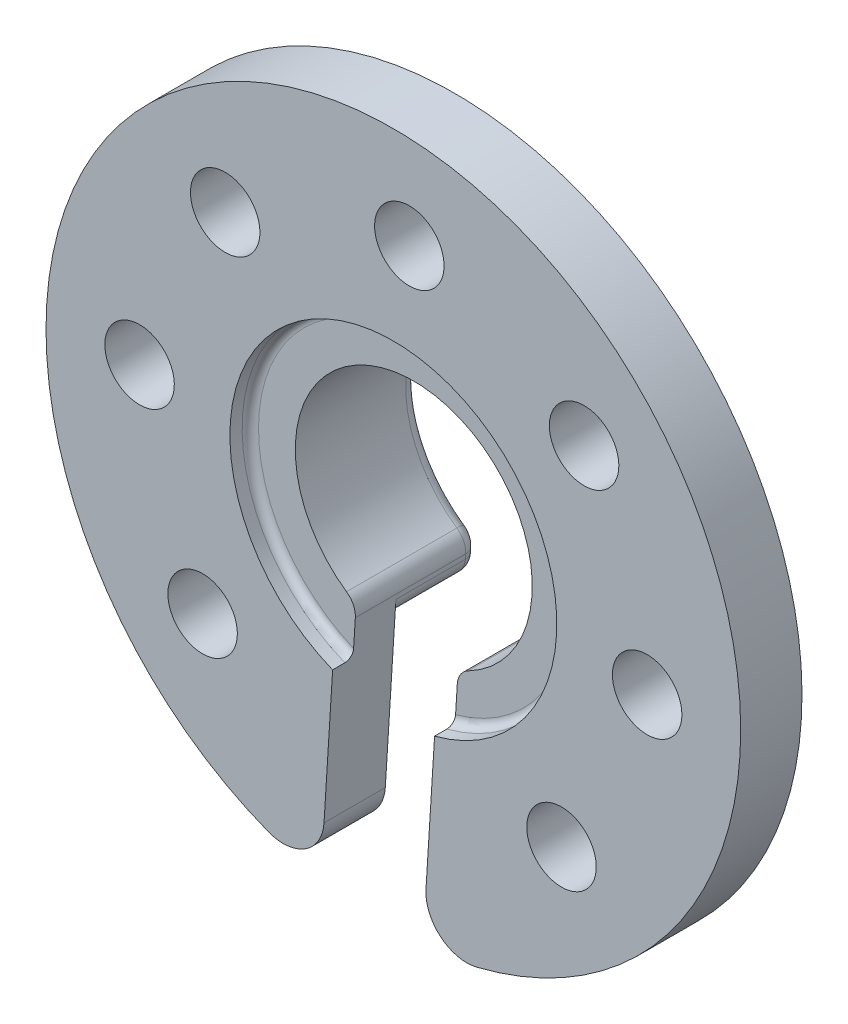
ISO-10303-21;
HEADER;
FILE_DESCRIPTION(('STEP AP214'),'2;1');
FILE_NAME('part.step','',(''),(''),'','','');
FILE_SCHEMA(('AUTOMOTIVE_DESIGN { 1 0 10303 214 1 1 1 1 }'));
ENDSEC;
DATA;
#1=APPLICATION_CONTEXT('core data for automotive mechanical design processes');
#2=APPLICATION_PROTOCOL_DEFINITION('international standard','automotive_design',2000,#1);
#3=PRODUCT_CONTEXT('',#1,'mechanical');
#4=PRODUCT('Part','Part','',(#3));
#5=PRODUCT_RELATED_PRODUCT_CATEGORY('part','',(#4));
#6=PRODUCT_DEFINITION_FORMATION('','',#4);
#7=PRODUCT_DEFINITION_CONTEXT('part definition',#1,'design');
#8=PRODUCT_DEFINITION('design','',#6,#7);
#9=PRODUCT_DEFINITION_SHAPE('','',#8);
#10=(LENGTH_UNIT() NAMED_UNIT(*) SI_UNIT(.MILLI.,.METRE.));
#11=(NAMED_UNIT(*) PLANE_ANGLE_UNIT() SI_UNIT($,.RADIAN.));
#12=(NAMED_UNIT(*) SI_UNIT($,.STERADIAN.) SOLID_ANGLE_UNIT());
#13=UNCERTAINTY_MEASURE_WITH_UNIT(LENGTH_MEASURE(1.E-05),#10,'distance_accuracy_value','');
#14=(GEOMETRIC_REPRESENTATION_CONTEXT(3) GLOBAL_UNCERTAINTY_ASSIGNED_CONTEXT((#13)) GLOBAL_UNIT_ASSIGNED_CONTEXT((#10,
#11,#12)) REPRESENTATION_CONTEXT('',''));
#15=CARTESIAN_POINT('',(0.,0.,0.));
#16=DIRECTION('',(0.,0.,1.));
#17=DIRECTION('',(1.,0.,0.));
#18=AXIS2_PLACEMENT_3D('',#15,#16,#17);
#19=CARTESIAN_POINT('',(3.0712856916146,1.47373350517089,-0.5));
#20=DIRECTION('',(0.,0.,1.));
#21=DIRECTION('',(0.,-1.,0.));
#22=AXIS2_PLACEMENT_3D('',#19,#20,#21);
#23=PLANE('',#22);
#24=DIRECTION('',(0.0627905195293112,0.998026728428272,0.));
#25=VECTOR('',#24,1.);
#26=CARTESIAN_POINT('',(-1.47285865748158,-3.5029540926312,-0.500000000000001));
#27=LINE('',#26,#25);
#28=CARTESIAN_POINT('',(-1.47285865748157,-3.50295409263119,-0.499999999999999));
#29=VERTEX_POINT('',#28);
#30=CARTESIAN_POINT('',(-1.43057073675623,-2.83080684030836,-0.5));
#31=VERTEX_POINT('',#30);
#32=EDGE_CURVE('E152',#29,#31,#27,.T.);
#33=ORIENTED_EDGE('',*,*,#32,.T.);
#34=CARTESIAN_POINT('',(-1.9295841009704,-2.7994115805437,-0.5));
#35=DIRECTION('',(0.,0.,-1.));
#36=DIRECTION('',(0.,1.,0.));
#37=AXIS2_PLACEMENT_3D('',#34,#35,#36);
#38=CIRCLE('',#37,0.5);
#39=CARTESIAN_POINT('',(-1.64582173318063,-2.38773340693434,-0.5));
#40=VERTEX_POINT('',#39);
#41=EDGE_CURVE('E171',#31,#40,#38,.F.);
#42=ORIENTED_EDGE('',*,*,#41,.T.);
#43=CARTESIAN_POINT('',(0.,0.,-0.5));
#44=DIRECTION('',(0.,0.,-1.));
#45=DIRECTION('',(0.,1.,0.));
#46=AXIS2_PLACEMENT_3D('',#43,#44,#45);
#47=CIRCLE('',#46,2.9);
#48=CARTESIAN_POINT('',(1.33358158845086,-2.57518157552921,-0.5));
#49=VERTEX_POINT('',#48);
#50=EDGE_CURVE('E474',#40,#49,#47,.T.);
#51=ORIENTED_EDGE('',*,*,#50,.T.);
#52=CARTESIAN_POINT('',(1.5635094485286,-3.0191783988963,-0.5));
#53=DIRECTION('',(0.,0.,-1.));
#54=DIRECTION('',(0.,1.,0.));
#55=AXIS2_PLACEMENT_3D('',#52,#53,#54);
#56=CIRCLE('',#55,0.5);
#57=CARTESIAN_POINT('',(1.06449608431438,-2.98778313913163,-0.5));
#58=VERTEX_POINT('',#57);
#59=EDGE_CURVE('E116',#49,#58,#56,.F.);
#60=ORIENTED_EDGE('',*,*,#59,.T.);
#61=DIRECTION('',(-0.0627905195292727,-0.998026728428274,0.));
#62=VECTOR('',#61,1.);
#63=CARTESIAN_POINT('',(1.06449608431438,-2.98778313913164,-0.500000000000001));
#64=LINE('',#63,#62);
#65=CARTESIAN_POINT('',(1.02220816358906,-3.65993039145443,-0.499999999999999));
#66=VERTEX_POINT('',#65);
#67=EDGE_CURVE('E142',#58,#66,#64,.T.);
#68=ORIENTED_EDGE('',*,*,#67,.T.);
#69=CARTESIAN_POINT('',(0.,0.,-0.499999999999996));
#70=DIRECTION('',(0.,0.,-1.));
#71=DIRECTION('',(0.,1.,0.));
#72=AXIS2_PLACEMENT_3D('',#69,#70,#71);
#73=CIRCLE('',#72,3.8);
#74=CARTESIAN_POINT('',(0.,3.79999999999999,-0.499999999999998));
#75=VERTEX_POINT('',#74);
#76=EDGE_CURVE('E147',#66,#75,#73,.F.);
#77=ORIENTED_EDGE('',*,*,#76,.T.);
#78=CARTESIAN_POINT('',(0.,0.,-0.499999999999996));
#79=DIRECTION('',(0.,0.,-1.));
#80=DIRECTION('',(-0.387594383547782,-0.921830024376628,0.));
#81=AXIS2_PLACEMENT_3D('',#78,#79,#80);
#82=CIRCLE('',#81,3.79999999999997);
#83=EDGE_CURVE('E169',#75,#29,#82,.F.);
#84=ORIENTED_EDGE('',*,*,#83,.T.);
#85=EDGE_LOOP('',(#33,#42,#51,#60,#68,#77,#84));
#86=FACE_BOUND('',#85,.T.);
#87=ADVANCED_FACE('F17',(#86),#23,.T.);
#88=CARTESIAN_POINT('',(0.,0.,-3.20000000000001));
#89=DIRECTION('',(0.,0.,-1.));
#90=DIRECTION('',(-1.,0.,0.));
#91=AXIS2_PLACEMENT_3D('',#88,#89,#90);
#92=TOROIDAL_SURFACE('',#91,3.19999999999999,0.299999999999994);
#93=CARTESIAN_POINT('',(1.47153830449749,-2.84157966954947,-3.2));
#94=DIRECTION('',(-0.887993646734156,-0.459855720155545,0.));
#95=DIRECTION('',(0.459855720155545,-0.887993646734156,0.));
#96=AXIS2_PLACEMENT_3D('',#93,#94,#95);
#97=CIRCLE('',#96,0.3);
#98=CARTESIAN_POINT('',(1.33358158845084,-2.57518157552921,-3.2));
#99=VERTEX_POINT('',#98);
#100=CARTESIAN_POINT('',(1.47153830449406,-2.84157966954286,-3.5));
#101=VERTEX_POINT('',#100);
#102=EDGE_CURVE('E124',#99,#101,#97,.T.);
#103=ORIENTED_EDGE('',*,*,#102,.F.);
#104=CARTESIAN_POINT('',(0.,0.,-3.2));
#105=DIRECTION('',(0.,0.,-1.));
#106=DIRECTION('',(0.,1.,0.));
#107=AXIS2_PLACEMENT_3D('',#104,#105,#106);
#108=CIRCLE('',#107,2.9);
#109=CARTESIAN_POINT('',(-1.64582173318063,-2.38773340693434,-3.2));
#110=VERTEX_POINT('',#109);
#111=EDGE_CURVE('E475',#99,#110,#108,.F.);
#112=ORIENTED_EDGE('',*,*,#111,.T.);
#113=CARTESIAN_POINT('',(-1.81607915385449,-2.63474031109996,-3.2));
#114=DIRECTION('',(0.823356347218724,-0.567524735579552,0.));
#115=DIRECTION('',(0.567524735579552,0.823356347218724,0.));
#116=AXIS2_PLACEMENT_3D('',#113,#114,#115);
#117=CIRCLE('',#116,0.3);
#118=CARTESIAN_POINT('',(-1.81607915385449,-2.63474031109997,-3.5));
#119=VERTEX_POINT('',#118);
#120=EDGE_CURVE('E163',#119,#110,#117,.T.);
#121=ORIENTED_EDGE('',*,*,#120,.F.);
#122=CARTESIAN_POINT('',(0.,0.,-3.5));
#123=DIRECTION('',(0.,0.,-1.));
#124=DIRECTION('',(-0.567524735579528,-0.82335634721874,0.));
#125=AXIS2_PLACEMENT_3D('',#122,#123,#124);
#126=CIRCLE('',#125,3.19999999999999);
#127=CARTESIAN_POINT('',(-1.17758369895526E-07,3.19999999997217,-3.5));
#128=VERTEX_POINT('',#127);
#129=EDGE_CURVE('E219',#119,#128,#126,.T.);
#130=ORIENTED_EDGE('',*,*,#129,.T.);
#131=CARTESIAN_POINT('',(0.,0.,-3.5));
#132=DIRECTION('',(0.,0.,-1.));
#133=DIRECTION('',(-3.67994890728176E-08,0.999999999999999,0.));
#134=AXIS2_PLACEMENT_3D('',#131,#132,#133);
#135=CIRCLE('',#134,3.19999999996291);
#136=EDGE_CURVE('E208',#128,#101,#135,.T.);
#137=ORIENTED_EDGE('',*,*,#136,.T.);
#138=EDGE_LOOP('',(#103,#112,#121,#130,#137));
#139=FACE_BOUND('',#138,.T.);
#140=ADVANCED_FACE('F191',(#139),#92,.T.);
#141=CARTESIAN_POINT('',(0.,0.,-0.299999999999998));
#142=DIRECTION('',(0.,0.,1.));
#143=DIRECTION('',(1.,0.,0.));
#144=AXIS2_PLACEMENT_3D('',#141,#142,#143);
#145=TOROIDAL_SURFACE('',#144,3.80000000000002,0.199999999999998);
#146=CARTESIAN_POINT('',(0.,0.,-0.299999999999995));
#147=DIRECTION('',(0.,0.,1.));
#148=DIRECTION('',(0.,-1.,0.));
#149=AXIS2_PLACEMENT_3D('',#146,#147,#148);
#150=CIRCLE('',#149,4.);
#151=CARTESIAN_POINT('',(1.00895009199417,-3.87066140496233,-0.299999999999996));
#152=VERTEX_POINT('',#151);
#153=CARTESIAN_POINT('',(-1.48611672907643,-3.71368510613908,-0.299999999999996));
#154=VERTEX_POINT('',#153);
#155=EDGE_CURVE('E201',#152,#154,#150,.T.);
#156=ORIENTED_EDGE('',*,*,#155,.T.);
#157=CARTESIAN_POINT('',(-1.47285865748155,-3.50295409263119,-0.499999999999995));
#158=CARTESIAN_POINT('',(-1.47363704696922,-3.51532623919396,-0.500007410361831));
#159=CARTESIAN_POINT('',(-1.47441558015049,-3.52770066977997,-0.498972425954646));
#160=CARTESIAN_POINT('',(-1.47595192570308,-3.55212018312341,-0.494859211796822));
#161=CARTESIAN_POINT('',(-1.47670971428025,-3.56416488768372,-0.491778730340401));
#162=CARTESIAN_POINT('',(-1.4781826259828,-3.58757614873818,-0.483611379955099));
#163=CARTESIAN_POINT('',(-1.47889769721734,-3.59894188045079,-0.478522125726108));
#164=CARTESIAN_POINT('',(-1.48026122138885,-3.6206144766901,-0.46644727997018));
#165=CARTESIAN_POINT('',(-1.48090972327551,-3.63092211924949,-0.459463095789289));
#166=CARTESIAN_POINT('',(-1.48209957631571,-3.6498342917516,-0.444007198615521));
#167=CARTESIAN_POINT('',(-1.48264362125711,-3.65848163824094,-0.435588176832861));
#168=CARTESIAN_POINT('',(-1.48362904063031,-3.6741444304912,-0.417345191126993));
#169=CARTESIAN_POINT('',(-1.48407046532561,-3.6811606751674,-0.407521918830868));
#170=CARTESIAN_POINT('',(-1.48481369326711,-3.69297394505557,-0.387301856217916));
#171=CARTESIAN_POINT('',(-1.48512158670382,-3.69786777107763,-0.376961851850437));
#172=CARTESIAN_POINT('',(-1.48561767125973,-3.705752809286,-0.355590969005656));
#173=CARTESIAN_POINT('',(-1.48580602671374,-3.70874663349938,-0.344561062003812));
#174=CARTESIAN_POINT('',(-1.48605484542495,-3.71270149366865,-0.322351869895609));
#175=CARTESIAN_POINT('',(-1.48611759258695,-3.71369883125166,-0.311179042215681));
#176=CARTESIAN_POINT('',(-1.48611672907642,-3.71368510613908,-0.299999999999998));
#177=B_SPLINE_CURVE_WITH_KNOTS('',3,(#157,#158,#159,#160,#161,#162,#163,#164,#165,#166,#167,
#168,#169,#170,#171,#172,#173,#174,#175,#176),.UNSPECIFIED.,.F.,.F.,(4,2,2,2,2,2,2,2,2,4),(0.,
0.0371508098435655,0.0743425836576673,0.111578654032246,0.148787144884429,0.184844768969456,
0.220884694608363,0.255041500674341,0.289151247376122,0.322634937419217),.UNSPECIFIED.);
#178=EDGE_CURVE('E164',#29,#154,#177,.T.);
#179=ORIENTED_EDGE('',*,*,#178,.F.);
#180=ORIENTED_EDGE('',*,*,#83,.F.);
#181=ORIENTED_EDGE('',*,*,#76,.F.);
#182=CARTESIAN_POINT('',(1.00895009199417,-3.87066140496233,-0.299999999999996));
#183=CARTESIAN_POINT('',(1.00894939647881,-3.87067245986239,-0.310839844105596));
#184=CARTESIAN_POINT('',(1.00900831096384,-3.86973604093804,-0.321673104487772));
#185=CARTESIAN_POINT('',(1.00923981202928,-3.86605643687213,-0.343004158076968));
#186=CARTESIAN_POINT('',(1.00941215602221,-3.86331710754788,-0.353502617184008));
#187=CARTESIAN_POINT('',(1.00986501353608,-3.85611914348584,-0.373890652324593));
#188=CARTESIAN_POINT('',(1.01014552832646,-3.85166048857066,-0.383780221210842));
#189=CARTESIAN_POINT('',(1.01080426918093,-3.84119010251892,-0.402686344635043));
#190=CARTESIAN_POINT('',(1.01118251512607,-3.83517805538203,-0.411702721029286));
#191=CARTESIAN_POINT('',(1.01246370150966,-3.8148141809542,-0.437439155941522));
#192=CARTESIAN_POINT('',(1.01350463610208,-3.79826899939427,-0.452479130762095));
#193=CARTESIAN_POINT('',(1.01588186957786,-3.76048395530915,-0.477257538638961));
#194=CARTESIAN_POINT('',(1.01722992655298,-3.73905720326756,-0.486707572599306));
#195=CARTESIAN_POINT('',(1.01921442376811,-3.7075145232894,-0.495075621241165));
#196=CARTESIAN_POINT('',(1.0198075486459,-3.69808707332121,-0.496921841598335));
#197=CARTESIAN_POINT('',(1.02100288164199,-3.67908779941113,-0.499381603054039));
#198=CARTESIAN_POINT('',(1.02160507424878,-3.66951622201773,-0.499997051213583));
#199=CARTESIAN_POINT('',(1.02220816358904,-3.65993039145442,-0.499999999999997));
#200=B_SPLINE_CURVE_WITH_KNOTS('',3,(#182,#183,#184,#185,#186,#187,#188,#189,#190,#191,#192,
#193,#194,#195,#196,#197,#198,#199),.UNSPECIFIED.,.F.,.F.,(4,2,2,2,2,2,2,2,4),(0.,
0.0324686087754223,0.0648680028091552,0.0972677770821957,0.129674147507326,0.195605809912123,
0.264695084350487,0.293505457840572,0.322271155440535),.UNSPECIFIED.);
#201=EDGE_CURVE('E155',#152,#66,#200,.T.);
#202=ORIENTED_EDGE('',*,*,#201,.F.);
#203=EDGE_LOOP('',(#156,#179,#180,#181,#202));
#204=FACE_BOUND('',#203,.T.);
#205=ADVANCED_FACE('F167',(#204),#145,.F.);
#206=CARTESIAN_POINT('',(-1.9295841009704,-2.7994115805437,-3.2));
#207=DIRECTION('',(0.,0.,-1.));
#208=DIRECTION('',(-1.,0.,0.));
#209=AXIS2_PLACEMENT_3D('',#206,#207,#208);
#210=DEGENERATE_TOROIDAL_SURFACE('',#209,0.199999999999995,0.3,.T.);
#211=CARTESIAN_POINT('',(-1.9295841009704,-2.7994115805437,-3.5));
#212=DIRECTION('',(0.,0.,-1.));
#213=DIRECTION('',(-1.,0.,0.));
#214=AXIS2_PLACEMENT_3D('',#211,#212,#213);
#215=CIRCLE('',#214,0.200000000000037);
#216=CARTESIAN_POINT('',(-1.72997875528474,-2.81196968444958,-3.5));
#217=VERTEX_POINT('',#216);
#218=EDGE_CURVE('E465',#217,#119,#215,.F.);
#219=ORIENTED_EDGE('',*,*,#218,.T.);
#220=ORIENTED_EDGE('',*,*,#120,.T.);
#221=CARTESIAN_POINT('',(-1.9295841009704,-2.7994115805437,-3.2));
#222=DIRECTION('',(0.,0.,-1.));
#223=DIRECTION('',(0.,1.,0.));
#224=AXIS2_PLACEMENT_3D('',#221,#222,#223);
#225=CIRCLE('',#224,0.5);
#226=CARTESIAN_POINT('',(-1.43057073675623,-2.83080684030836,-3.20000000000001));
#227=VERTEX_POINT('',#226);
#228=EDGE_CURVE('E322',#227,#110,#225,.F.);
#229=ORIENTED_EDGE('',*,*,#228,.F.);
#230=CARTESIAN_POINT('',(-1.72997875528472,-2.81196968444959,-3.2));
#231=DIRECTION('',(0.0627905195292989,0.998026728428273,0.));
#232=DIRECTION('',(-0.998026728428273,0.0627905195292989,0.));
#233=AXIS2_PLACEMENT_3D('',#230,#231,#232);
#234=CIRCLE('',#233,0.3);
#235=EDGE_CURVE('E298',#217,#227,#234,.F.);
#236=ORIENTED_EDGE('',*,*,#235,.F.);
#237=EDGE_LOOP('',(#219,#220,#229,#236));
#238=FACE_BOUND('',#237,.T.);
#239=ADVANCED_FACE('F190',(#238),#210,.T.);
#240=CARTESIAN_POINT('',(0.,0.,-3.5));
#241=DIRECTION('',(0.,0.,-1.));
#242=DIRECTION('',(0.,1.,0.));
#243=AXIS2_PLACEMENT_3D('',#240,#241,#242);
#244=CYLINDRICAL_SURFACE('',#243,2.9);
#245=DIRECTION('',(0.,0.,-1.));
#246=VECTOR('',#245,1.);
#247=CARTESIAN_POINT('',(-1.64582173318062,-2.38773340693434,-3.5));
#248=LINE('',#247,#246);
#249=EDGE_CURVE('E336',#110,#40,#248,.F.);
#250=ORIENTED_EDGE('',*,*,#249,.F.);
#251=ORIENTED_EDGE('',*,*,#111,.F.);
#252=DIRECTION('',(0.,0.,-1.));
#253=VECTOR('',#252,1.);
#254=CARTESIAN_POINT('',(1.33358158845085,-2.57518157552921,-3.5));
#255=LINE('',#254,#253);
#256=EDGE_CURVE('E282',#49,#99,#255,.T.);
#257=ORIENTED_EDGE('',*,*,#256,.F.);
#258=ORIENTED_EDGE('',*,*,#50,.F.);
#259=EDGE_LOOP('',(#250,#251,#257,#258));
#260=FACE_BOUND('',#259,.T.);
#261=ADVANCED_FACE('F192',(#260),#244,.F.);
#262=CARTESIAN_POINT('',(1.5635094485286,-3.0191783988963,-3.2));
#263=DIRECTION('',(0.,0.,-1.));
#264=DIRECTION('',(-1.,0.,0.));
#265=AXIS2_PLACEMENT_3D('',#262,#263,#264);
#266=DEGENERATE_TOROIDAL_SURFACE('',#265,0.200000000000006,0.3,.T.);
#267=CARTESIAN_POINT('',(1.5635094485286,-3.0191783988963,-3.5));
#268=DIRECTION('',(0.,0.,-1.));
#269=DIRECTION('',(-1.,0.,0.));
#270=AXIS2_PLACEMENT_3D('',#267,#268,#269);
#271=CIRCLE('',#270,0.200000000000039);
#272=CARTESIAN_POINT('',(1.36390410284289,-3.00662029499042,-3.5));
#273=VERTEX_POINT('',#272);
#274=EDGE_CURVE('E468',#101,#273,#271,.F.);
#275=ORIENTED_EDGE('',*,*,#274,.T.);
#276=CARTESIAN_POINT('',(1.36390410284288,-3.00662029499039,-3.2));
#277=DIRECTION('',(-0.062790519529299,-0.998026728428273,0.));
#278=DIRECTION('',(0.998026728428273,-0.062790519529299,0.));
#279=AXIS2_PLACEMENT_3D('',#276,#277,#278);
#280=CIRCLE('',#279,0.299999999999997);
#281=CARTESIAN_POINT('',(1.06449608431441,-2.9877831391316,-3.2));
#282=VERTEX_POINT('',#281);
#283=EDGE_CURVE('E294',#282,#273,#280,.T.);
#284=ORIENTED_EDGE('',*,*,#283,.F.);
#285=CARTESIAN_POINT('',(1.5635094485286,-3.0191783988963,-3.2));
#286=DIRECTION('',(0.,0.,-1.));
#287=DIRECTION('',(0.,1.,0.));
#288=AXIS2_PLACEMENT_3D('',#285,#286,#287);
#289=CIRCLE('',#288,0.5);
#290=EDGE_CURVE('E277',#99,#282,#289,.F.);
#291=ORIENTED_EDGE('',*,*,#290,.F.);
#292=ORIENTED_EDGE('',*,*,#102,.T.);
#293=EDGE_LOOP('',(#275,#284,#291,#292));
#294=FACE_BOUND('',#293,.T.);
#295=ADVANCED_FACE('F359',(#294),#266,.T.);
#296=CARTESIAN_POINT('',(-1.7410832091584,10.9514896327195,-3.5));
#297=DIRECTION('',(0.,0.,1.));
#298=DIRECTION('',(0.,-1.,0.));
#299=AXIS2_PLACEMENT_3D('',#296,#297,#298);
#300=PLANE('',#299);
#301=DIRECTION('',(0.0627905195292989,0.998026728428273,0.));
#302=VECTOR('',#301,1.);
#303=CARTESIAN_POINT('',(-1.67611957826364,-1.9559025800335,-3.5));
#304=LINE('',#303,#302);
#305=CARTESIAN_POINT('',(-1.73726507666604,-2.92778244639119,-3.5));
#306=VERTEX_POINT('',#305);
#307=EDGE_CURVE('E321',#306,#217,#304,.T.);
#308=ORIENTED_EDGE('',*,*,#307,.F.);
#309=CARTESIAN_POINT('',(-1.9368704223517,-2.9152243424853,-3.5));
#310=DIRECTION('',(0.,0.,-1.));
#311=DIRECTION('',(0.,1.,0.));
#312=AXIS2_PLACEMENT_3D('',#309,#310,#311);
#313=CIRCLE('',#312,0.199999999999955);
#314=CARTESIAN_POINT('',(-2.04754873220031,-3.08180859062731,-3.5));
#315=VERTEX_POINT('',#314);
#316=EDGE_CURVE('E342',#315,#306,#313,.F.);
#317=ORIENTED_EDGE('',*,*,#316,.F.);
#318=CARTESIAN_POINT('',(0.,0.,-3.50000000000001));
#319=DIRECTION('',(0.,0.,1.));
#320=DIRECTION('',(0.444635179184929,-0.895711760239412,0.));
#321=AXIS2_PLACEMENT_3D('',#318,#319,#320);
#322=CIRCLE('',#321,3.69999999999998);
#323=CARTESIAN_POINT('',(1.64515016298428,-3.31413351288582,-3.5));
#324=VERTEX_POINT('',#323);
#325=EDGE_CURVE('E374',#324,#315,#322,.T.);
#326=ORIENTED_EDGE('',*,*,#325,.F.);
#327=CARTESIAN_POINT('',(1.55622312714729,-3.13499116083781,-3.5));
#328=DIRECTION('',(0.,0.,-1.));
#329=DIRECTION('',(0.,1.,0.));
#330=AXIS2_PLACEMENT_3D('',#327,#328,#329);
#331=CIRCLE('',#330,0.200000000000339);
#332=CARTESIAN_POINT('',(1.35661778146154,-3.12243305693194,-3.5));
#333=VERTEX_POINT('',#332);
#334=EDGE_CURVE('E264',#333,#324,#331,.F.);
#335=ORIENTED_EDGE('',*,*,#334,.F.);
#336=DIRECTION('',(-0.062790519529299,-0.998026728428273,0.));
#337=VECTOR('',#336,1.);
#338=CARTESIAN_POINT('',(1.4300096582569,-1.9559025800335,-3.5));
#339=LINE('',#338,#337);
#340=EDGE_CURVE('E297',#273,#333,#339,.T.);
#341=ORIENTED_EDGE('',*,*,#340,.F.);
#342=ORIENTED_EDGE('',*,*,#274,.F.);
#343=ORIENTED_EDGE('',*,*,#136,.F.);
#344=ORIENTED_EDGE('',*,*,#129,.F.);
#345=ORIENTED_EDGE('',*,*,#218,.F.);
#346=EDGE_LOOP('',(#308,#317,#326,#335,#341,#342,#343,#344,#345));
#347=FACE_BOUND('',#346,.T.);
#348=ADVANCED_FACE('F349',(#347),#300,.F.);
#349=CARTESIAN_POINT('',(0.,0.,0.));
#350=DIRECTION('',(0.,0.,1.));
#351=DIRECTION('',(0.,-1.,0.));
#352=AXIS2_PLACEMENT_3D('',#349,#350,#351);
#353=CYLINDRICAL_SURFACE('',#352,4.);
#354=CARTESIAN_POINT('',(0.,0.,0.));
#355=DIRECTION('',(0.,0.,1.));
#356=DIRECTION('',(0.,-1.,0.));
#357=AXIS2_PLACEMENT_3D('',#354,#355,#356);
#358=CIRCLE('',#357,4.);
#359=CARTESIAN_POINT('',(-1.48611672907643,-3.71368510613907,0.));
#360=VERTEX_POINT('',#359);
#361=CARTESIAN_POINT('',(1.00895009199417,-3.87066140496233,0.));
#362=VERTEX_POINT('',#361);
#363=EDGE_CURVE('E450',#360,#362,#358,.F.);
#364=ORIENTED_EDGE('',*,*,#363,.F.);
#365=DIRECTION('',(0.,0.,1.));
#366=VECTOR('',#365,1.);
#367=CARTESIAN_POINT('',(-1.48611672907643,-3.71368510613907,0.));
#368=LINE('',#367,#366);
#369=EDGE_CURVE('E339',#154,#360,#368,.T.);
#370=ORIENTED_EDGE('',*,*,#369,.F.);
#371=ORIENTED_EDGE('',*,*,#155,.F.);
#372=DIRECTION('',(0.,0.,1.));
#373=VECTOR('',#372,1.);
#374=CARTESIAN_POINT('',(1.00895009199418,-3.87066140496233,0.));
#375=LINE('',#374,#373);
#376=EDGE_CURVE('E159',#362,#152,#375,.F.);
#377=ORIENTED_EDGE('',*,*,#376,.F.);
#378=EDGE_LOOP('',(#364,#370,#371,#377));
#379=FACE_BOUND('',#378,.T.);
#380=ADVANCED_FACE('F358',(#379),#353,.F.);
#381=CARTESIAN_POINT('',(-1.9368704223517,-2.9152243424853,-3.2));
#382=DIRECTION('',(0.,0.,-1.));
#383=DIRECTION('',(0.,1.,0.));
#384=AXIS2_PLACEMENT_3D('',#381,#382,#383);
#385=DEGENERATE_TOROIDAL_SURFACE('',#384,0.200000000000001,0.3,.T.);
#386=ORIENTED_EDGE('',*,*,#316,.T.);
#387=CARTESIAN_POINT('',(-1.737265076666,-2.92778244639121,-3.2));
#388=DIRECTION('',(0.0627905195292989,0.998026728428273,0.));
#389=DIRECTION('',(-0.998026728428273,0.0627905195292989,0.));
#390=AXIS2_PLACEMENT_3D('',#387,#388,#389);
#391=CIRCLE('',#390,0.3);
#392=CARTESIAN_POINT('',(-1.43785705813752,-2.94661960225,-3.2));
#393=VERTEX_POINT('',#392);
#394=EDGE_CURVE('E318',#393,#306,#391,.T.);
#395=ORIENTED_EDGE('',*,*,#394,.F.);
#396=CARTESIAN_POINT('',(-1.9368704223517,-2.9152243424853,-3.2));
#397=DIRECTION('',(0.,0.,-1.));
#398=DIRECTION('',(0.,1.,0.));
#399=AXIS2_PLACEMENT_3D('',#396,#397,#398);
#400=CIRCLE('',#399,0.5);
#401=CARTESIAN_POINT('',(-2.2135661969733,-3.33168496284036,-3.2));
#402=VERTEX_POINT('',#401);
#403=EDGE_CURVE('E331',#402,#393,#400,.F.);
#404=ORIENTED_EDGE('',*,*,#403,.F.);
#405=CARTESIAN_POINT('',(-2.0475487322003,-3.08180859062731,-3.20000000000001));
#406=DIRECTION('',(-0.832921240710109,0.55339154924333,0.));
#407=DIRECTION('',(-0.55339154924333,-0.832921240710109,0.));
#408=AXIS2_PLACEMENT_3D('',#405,#406,#407);
#409=CIRCLE('',#408,0.299999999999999);
#410=EDGE_CURVE('E266',#315,#402,#409,.T.);
#411=ORIENTED_EDGE('',*,*,#410,.F.);
#412=EDGE_LOOP('',(#386,#395,#404,#411));
#413=FACE_BOUND('',#412,.T.);
#414=ADVANCED_FACE('F610',(#413),#385,.T.);
#415=CARTESIAN_POINT('',(-1.9295841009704,-2.7994115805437,-3.5));
#416=DIRECTION('',(0.,0.,-1.));
#417=DIRECTION('',(0.,1.,0.));
#418=AXIS2_PLACEMENT_3D('',#415,#416,#417);
#419=CYLINDRICAL_SURFACE('',#418,0.5);
#420=DIRECTION('',(0.,0.,1.));
#421=VECTOR('',#420,1.);
#422=CARTESIAN_POINT('',(-1.43057073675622,-2.83080684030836,0.));
#423=LINE('',#422,#421);
#424=EDGE_CURVE('E315',#31,#227,#423,.F.);
#425=ORIENTED_EDGE('',*,*,#424,.T.);
#426=ORIENTED_EDGE('',*,*,#228,.T.);
#427=ORIENTED_EDGE('',*,*,#249,.T.);
#428=ORIENTED_EDGE('',*,*,#41,.F.);
#429=EDGE_LOOP('',(#425,#426,#427,#428));
#430=FACE_BOUND('',#429,.T.);
#431=ADVANCED_FACE('F614',(#430),#419,.T.);
#432=CARTESIAN_POINT('',(-1.6761195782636,-1.9559025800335,-3.2));
#433=DIRECTION('',(0.0627905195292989,0.998026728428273,0.));
#434=DIRECTION('',(-0.998026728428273,0.0627905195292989,0.));
#435=AXIS2_PLACEMENT_3D('',#432,#433,#434);
#436=CYLINDRICAL_SURFACE('',#435,0.3);
#437=ORIENTED_EDGE('',*,*,#307,.T.);
#438=ORIENTED_EDGE('',*,*,#235,.T.);
#439=DIRECTION('',(-0.0627905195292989,-0.998026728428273,0.));
#440=VECTOR('',#439,1.);
#441=CARTESIAN_POINT('',(-1.3034794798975,-0.810749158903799,-3.20000000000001));
#442=LINE('',#441,#440);
#443=EDGE_CURVE('E312',#227,#393,#442,.T.);
#444=ORIENTED_EDGE('',*,*,#443,.T.);
#445=ORIENTED_EDGE('',*,*,#394,.T.);
#446=EDGE_LOOP('',(#437,#438,#444,#445));
#447=FACE_BOUND('',#446,.T.);
#448=ADVANCED_FACE('F619',(#447),#436,.T.);
#449=CARTESIAN_POINT('',(1.4300096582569,-1.9559025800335,-3.2));
#450=DIRECTION('',(-0.062790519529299,-0.998026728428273,0.));
#451=DIRECTION('',(0.998026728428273,-0.062790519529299,0.));
#452=AXIS2_PLACEMENT_3D('',#449,#450,#451);
#453=CYLINDRICAL_SURFACE('',#452,0.299999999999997);
#454=ORIENTED_EDGE('',*,*,#283,.T.);
#455=ORIENTED_EDGE('',*,*,#340,.T.);
#456=CARTESIAN_POINT('',(1.35661778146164,-3.12243305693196,-3.2));
#457=DIRECTION('',(-0.0627905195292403,-0.998026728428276,0.));
#458=DIRECTION('',(0.998026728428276,-0.0627905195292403,0.));
#459=AXIS2_PLACEMENT_3D('',#456,#457,#458);
#460=CIRCLE('',#459,0.3);
#461=CARTESIAN_POINT('',(1.05720976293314,-3.10359590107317,-3.2));
#462=VERTEX_POINT('',#461);
#463=EDGE_CURVE('E267',#462,#333,#460,.T.);
#464=ORIENTED_EDGE('',*,*,#463,.F.);
#465=DIRECTION('',(0.0627905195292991,0.998026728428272,0.));
#466=VECTOR('',#465,1.);
#467=CARTESIAN_POINT('',(1.0762924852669,-2.8002847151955,-3.2));
#468=LINE('',#467,#466);
#469=EDGE_CURVE('E304',#462,#282,#468,.T.);
#470=ORIENTED_EDGE('',*,*,#469,.T.);
#471=EDGE_LOOP('',(#454,#455,#464,#470));
#472=FACE_BOUND('',#471,.T.);
#473=ADVANCED_FACE('F632',(#472),#453,.T.);
#474=CARTESIAN_POINT('',(1.5635094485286,-3.0191783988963,-3.5));
#475=DIRECTION('',(0.,0.,-1.));
#476=DIRECTION('',(0.,1.,0.));
#477=AXIS2_PLACEMENT_3D('',#474,#475,#476);
#478=CYLINDRICAL_SURFACE('',#477,0.5);
#479=ORIENTED_EDGE('',*,*,#256,.T.);
#480=ORIENTED_EDGE('',*,*,#290,.T.);
#481=DIRECTION('',(0.,0.,1.));
#482=VECTOR('',#481,1.);
#483=CARTESIAN_POINT('',(1.06449608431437,-2.9877831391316,-3.85024));
#484=LINE('',#483,#482);
#485=EDGE_CURVE('E293',#282,#58,#484,.T.);
#486=ORIENTED_EDGE('',*,*,#485,.T.);
#487=ORIENTED_EDGE('',*,*,#59,.F.);
#488=EDGE_LOOP('',(#479,#480,#486,#487));
#489=FACE_BOUND('',#488,.T.);
#490=ADVANCED_FACE('F404',(#489),#478,.T.);
#491=CARTESIAN_POINT('',(1.55622312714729,-3.1349911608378,-3.2));
#492=DIRECTION('',(0.,0.,-1.));
#493=DIRECTION('',(0.,1.,0.));
#494=AXIS2_PLACEMENT_3D('',#491,#492,#493);
#495=DEGENERATE_TOROIDAL_SURFACE('',#494,0.199999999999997,0.3,.T.);
#496=ORIENTED_EDGE('',*,*,#463,.T.);
#497=ORIENTED_EDGE('',*,*,#334,.T.);
#498=CARTESIAN_POINT('',(1.64515016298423,-3.31413351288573,-3.20000000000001));
#499=DIRECTION('',(-0.895711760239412,-0.444635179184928,0.));
#500=DIRECTION('',(0.444635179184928,-0.895711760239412,0.));
#501=AXIS2_PLACEMENT_3D('',#498,#499,#500);
#502=CIRCLE('',#501,0.299999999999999);
#503=CARTESIAN_POINT('',(1.77854071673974,-3.58284704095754,-3.2));
#504=VERTEX_POINT('',#503);
#505=EDGE_CURVE('E275',#504,#324,#502,.F.);
#506=ORIENTED_EDGE('',*,*,#505,.F.);
#507=CARTESIAN_POINT('',(1.5562231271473,-3.13499116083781,-3.2));
#508=DIRECTION('',(0.,0.,-1.));
#509=DIRECTION('',(0.,1.,0.));
#510=AXIS2_PLACEMENT_3D('',#507,#508,#509);
#511=CIRCLE('',#510,0.5);
#512=EDGE_CURVE('E439',#462,#504,#511,.F.);
#513=ORIENTED_EDGE('',*,*,#512,.F.);
#514=EDGE_LOOP('',(#496,#497,#506,#513));
#515=FACE_BOUND('',#514,.T.);
#516=ADVANCED_FACE('F19',(#515),#495,.T.);
#517=CARTESIAN_POINT('',(0.,0.,-3.20000000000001));
#518=DIRECTION('',(0.,0.,-1.));
#519=DIRECTION('',(-1.,0.,0.));
#520=AXIS2_PLACEMENT_3D('',#517,#518,#519);
#521=TOROIDAL_SURFACE('',#520,3.69999999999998,0.299999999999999);
#522=ORIENTED_EDGE('',*,*,#505,.T.);
#523=ORIENTED_EDGE('',*,*,#325,.T.);
#524=ORIENTED_EDGE('',*,*,#410,.T.);
#525=CARTESIAN_POINT('',(0.,0.,-3.2));
#526=DIRECTION('',(0.,0.,-1.));
#527=DIRECTION('',(0.,1.,0.));
#528=AXIS2_PLACEMENT_3D('',#525,#526,#527);
#529=CIRCLE('',#528,4.);
#530=EDGE_CURVE('E444',#504,#402,#529,.F.);
#531=ORIENTED_EDGE('',*,*,#530,.F.);
#532=EDGE_LOOP('',(#522,#523,#524,#531));
#533=FACE_BOUND('',#532,.T.);
#534=ADVANCED_FACE('F391',(#533),#521,.T.);
#535=CARTESIAN_POINT('',(6.8273362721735,1.8020634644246,0.));
#536=DIRECTION('',(0.,0.,1.));
#537=DIRECTION('',(0.,-1.,0.));
#538=AXIS2_PLACEMENT_3D('',#535,#536,#537);
#539=PLANE('',#538);
#540=CARTESIAN_POINT('',(4.1150393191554,-4.6675958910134,0.));
#541=DIRECTION('',(0.,0.,1.));
#542=DIRECTION('',(0.,-1.,0.));
#543=AXIS2_PLACEMENT_3D('',#540,#541,#542);
#544=CIRCLE('',#543,0.85);
#545=CARTESIAN_POINT('',(4.1150393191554,-5.5175958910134,0.));
#546=VERTEX_POINT('',#545);
#547=EDGE_CURVE('E582',#546,#546,#544,.F.);
#548=ORIENTED_EDGE('',*,*,#547,.T.);
#549=EDGE_LOOP('',(#548));
#550=FACE_BOUND('',#549,.T.);
#551=CARTESIAN_POINT('',(-4.6675958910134,-4.1150393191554,0.));
#552=DIRECTION('',(0.,0.,1.));
#553=DIRECTION('',(0.,-1.,0.));
#554=AXIS2_PLACEMENT_3D('',#551,#552,#553);
#555=CIRCLE('',#554,0.85);
#556=CARTESIAN_POINT('',(-4.6675958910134,-4.9650393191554,0.));
#557=VERTEX_POINT('',#556);
#558=EDGE_CURVE('E585',#557,#557,#555,.F.);
#559=ORIENTED_EDGE('',*,*,#558,.T.);
#560=EDGE_LOOP('',(#559));
#561=FACE_BOUND('',#560,.T.);
#562=CARTESIAN_POINT('',(-4.1150393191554,4.6675958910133,0.));
#563=DIRECTION('',(0.,0.,1.));
#564=DIRECTION('',(0.,-1.,0.));
#565=AXIS2_PLACEMENT_3D('',#562,#563,#564);
#566=CIRCLE('',#565,0.85);
#567=CARTESIAN_POINT('',(-4.1150393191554,3.8175958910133,0.));
#568=VERTEX_POINT('',#567);
#569=EDGE_CURVE('E588',#568,#568,#566,.F.);
#570=ORIENTED_EDGE('',*,*,#569,.T.);
#571=EDGE_LOOP('',(#570));
#572=FACE_BOUND('',#571,.T.);
#573=CARTESIAN_POINT('',(4.6675958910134,4.1150393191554,0.));
#574=DIRECTION('',(0.,0.,1.));
#575=DIRECTION('',(0.,-1.,0.));
#576=AXIS2_PLACEMENT_3D('',#573,#574,#575);
#577=CIRCLE('',#576,0.85);
#578=CARTESIAN_POINT('',(4.6675958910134,3.2650393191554,0.));
#579=VERTEX_POINT('',#578);
#580=EDGE_CURVE('E579',#579,#579,#577,.F.);
#581=ORIENTED_EDGE('',*,*,#580,.T.);
#582=EDGE_LOOP('',(#581));
#583=FACE_BOUND('',#582,.T.);
#584=CARTESIAN_POINT('',(6.2102609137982,-0.390716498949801,0.));
#585=DIRECTION('',(0.,0.,1.));
#586=DIRECTION('',(0.,-1.,0.));
#587=AXIS2_PLACEMENT_3D('',#584,#585,#586);
#588=CIRCLE('',#587,0.85);
#589=CARTESIAN_POINT('',(6.2102609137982,-1.2407164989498,0.));
#590=VERTEX_POINT('',#589);
#591=EDGE_CURVE('E594',#590,#590,#588,.F.);
#592=ORIENTED_EDGE('',*,*,#591,.T.);
#593=EDGE_LOOP('',(#592));
#594=FACE_BOUND('',#593,.T.);
#595=CARTESIAN_POINT('',(-6.2102609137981,0.390716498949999,0.));
#596=DIRECTION('',(0.,0.,1.));
#597=DIRECTION('',(0.,-1.,0.));
#598=AXIS2_PLACEMENT_3D('',#595,#596,#597);
#599=CIRCLE('',#598,0.85);
#600=CARTESIAN_POINT('',(-6.2102609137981,-0.459283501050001,0.));
#601=VERTEX_POINT('',#600);
#602=EDGE_CURVE('E597',#601,#601,#599,.F.);
#603=ORIENTED_EDGE('',*,*,#602,.T.);
#604=EDGE_LOOP('',(#603));
#605=FACE_BOUND('',#604,.T.);
#606=CARTESIAN_POINT('',(0.390716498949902,6.2102609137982,0.));
#607=DIRECTION('',(0.,0.,1.));
#608=DIRECTION('',(0.,-1.,0.));
#609=AXIS2_PLACEMENT_3D('',#606,#607,#608);
#610=CIRCLE('',#609,0.85);
#611=CARTESIAN_POINT('',(0.390716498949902,5.3602609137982,0.));
#612=VERTEX_POINT('',#611);
#613=EDGE_CURVE('E591',#612,#612,#610,.F.);
#614=ORIENTED_EDGE('',*,*,#613,.T.);
#615=EDGE_LOOP('',(#614));
#616=FACE_BOUND('',#615,.T.);
#617=DIRECTION('',(0.0627905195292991,0.998026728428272,0.));
#618=VECTOR('',#617,1.);
#619=CARTESIAN_POINT('',(1.0762924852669,-2.8002847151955,0.));
#620=LINE('',#619,#618);
#621=CARTESIAN_POINT('',(0.798295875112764,-7.2189143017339,0.));
#622=VERTEX_POINT('',#621);
#623=EDGE_CURVE('E290',#362,#622,#620,.F.);
#624=ORIENTED_EDGE('',*,*,#623,.T.);
#625=CARTESIAN_POINT('',(1.79632260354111,-7.28170482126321,0.));
#626=DIRECTION('',(0.,0.,1.));
#627=DIRECTION('',(0.,-1.,0.));
#628=AXIS2_PLACEMENT_3D('',#625,#626,#627);
#629=CIRCLE('',#628,0.999999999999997);
#630=CARTESIAN_POINT('',(2.03583228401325,-8.25259879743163,0.));
#631=VERTEX_POINT('',#630);
#632=EDGE_CURVE('E420',#631,#622,#629,.F.);
#633=ORIENTED_EDGE('',*,*,#632,.F.);
#634=CARTESIAN_POINT('',(0.,0.,0.));
#635=DIRECTION('',(0.,0.,1.));
#636=DIRECTION('',(0.,-1.,0.));
#637=AXIS2_PLACEMENT_3D('',#634,#635,#636);
#638=CIRCLE('',#637,8.5);
#639=CARTESIAN_POINT('',(-3.05410403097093,-7.93236714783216,0.));
#640=VERTEX_POINT('',#639);
#641=EDGE_CURVE('E425',#640,#631,#638,.F.);
#642=ORIENTED_EDGE('',*,*,#641,.F.);
#643=CARTESIAN_POINT('',(-2.69479767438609,-6.9991474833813,0.));
#644=DIRECTION('',(0.,0.,1.));
#645=DIRECTION('',(0.,-1.,0.));
#646=AXIS2_PLACEMENT_3D('',#643,#644,#645);
#647=CIRCLE('',#646,1.);
#648=CARTESIAN_POINT('',(-1.69677094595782,-7.06193800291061,0.));
#649=VERTEX_POINT('',#648);
#650=EDGE_CURVE('E433',#649,#640,#647,.F.);
#651=ORIENTED_EDGE('',*,*,#650,.F.);
#652=DIRECTION('',(-0.0627905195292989,-0.998026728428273,0.));
#653=VECTOR('',#652,1.);
#654=CARTESIAN_POINT('',(-1.3034794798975,-0.810749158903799,0.));
#655=LINE('',#654,#653);
#656=EDGE_CURVE('E307',#649,#360,#655,.F.);
#657=ORIENTED_EDGE('',*,*,#656,.T.);
#658=ORIENTED_EDGE('',*,*,#363,.T.);
#659=EDGE_LOOP('',(#624,#633,#642,#651,#657,#658));
#660=FACE_BOUND('',#659,.T.);
#661=ADVANCED_FACE('F402',(#550,#561,#572,#583,#594,#605,#616,#660),#539,.T.);
#662=CARTESIAN_POINT('',(-1.9368704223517,-2.9152243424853,-1.4999999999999));
#663=DIRECTION('',(0.,0.,-1.));
#664=DIRECTION('',(0.,1.,0.));
#665=AXIS2_PLACEMENT_3D('',#662,#663,#664);
#666=CYLINDRICAL_SURFACE('',#665,0.5);
#667=CARTESIAN_POINT('',(-1.9368704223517,-2.9152243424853,-1.4999999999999));
#668=DIRECTION('',(0.,0.,-1.));
#669=DIRECTION('',(0.,1.,0.));
#670=AXIS2_PLACEMENT_3D('',#667,#668,#669);
#671=CIRCLE('',#670,0.5);
#672=CARTESIAN_POINT('',(-2.21356619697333,-3.33168496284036,-1.4999999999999));
#673=VERTEX_POINT('',#672);
#674=CARTESIAN_POINT('',(-1.4378570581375,-2.94661960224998,-1.4999999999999));
#675=VERTEX_POINT('',#674);
#676=EDGE_CURVE('E577',#673,#675,#671,.F.);
#677=ORIENTED_EDGE('',*,*,#676,.F.);
#678=DIRECTION('',(0.,0.,-1.));
#679=VECTOR('',#678,1.);
#680=CARTESIAN_POINT('',(-2.2135661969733,-3.33168496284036,-1.4999999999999));
#681=LINE('',#680,#679);
#682=EDGE_CURVE('E447',#402,#673,#681,.F.);
#683=ORIENTED_EDGE('',*,*,#682,.F.);
#684=ORIENTED_EDGE('',*,*,#403,.T.);
#685=DIRECTION('',(0.,0.,1.));
#686=VECTOR('',#685,1.);
#687=CARTESIAN_POINT('',(-1.4378570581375,-2.94661960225,0.));
#688=LINE('',#687,#686);
#689=EDGE_CURVE('E311',#393,#675,#688,.T.);
#690=ORIENTED_EDGE('',*,*,#689,.T.);
#691=EDGE_LOOP('',(#677,#683,#684,#690));
#692=FACE_BOUND('',#691,.T.);
#693=ADVANCED_FACE('F501',(#692),#666,.T.);
#694=CARTESIAN_POINT('',(-1.3034794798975,-0.810749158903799,0.));
#695=DIRECTION('',(-0.998026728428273,0.0627905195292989,0.));
#696=DIRECTION('',(-0.0627905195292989,-0.998026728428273,0.));
#697=AXIS2_PLACEMENT_3D('',#694,#695,#696);
#698=PLANE('',#697);
#699=ORIENTED_EDGE('',*,*,#369,.T.);
#700=ORIENTED_EDGE('',*,*,#656,.F.);
#701=DIRECTION('',(0.,0.,1.));
#702=VECTOR('',#701,1.);
#703=CARTESIAN_POINT('',(-1.69677094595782,-7.06193800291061,-4.0142399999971));
#704=LINE('',#703,#702);
#705=CARTESIAN_POINT('',(-1.69677094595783,-7.06193800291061,-1.4999999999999));
#706=VERTEX_POINT('',#705);
#707=EDGE_CURVE('E310',#706,#649,#704,.T.);
#708=ORIENTED_EDGE('',*,*,#707,.F.);
#709=DIRECTION('',(-0.0627905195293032,-0.998026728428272,0.));
#710=VECTOR('',#709,1.);
#711=CARTESIAN_POINT('',(-1.4378570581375,-2.94661960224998,-1.4999999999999));
#712=LINE('',#711,#710);
#713=EDGE_CURVE('E576',#675,#706,#712,.T.);
#714=ORIENTED_EDGE('',*,*,#713,.F.);
#715=ORIENTED_EDGE('',*,*,#689,.F.);
#716=ORIENTED_EDGE('',*,*,#443,.F.);
#717=ORIENTED_EDGE('',*,*,#424,.F.);
#718=ORIENTED_EDGE('',*,*,#32,.F.);
#719=ORIENTED_EDGE('',*,*,#178,.T.);
#720=EDGE_LOOP('',(#699,#700,#708,#714,#715,#716,#717,#718,#719));
#721=FACE_BOUND('',#720,.T.);
#722=ADVANCED_FACE('F497',(#721),#698,.F.);
#723=CARTESIAN_POINT('',(-2.69479767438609,-6.9991474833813,-4.0142399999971));
#724=DIRECTION('',(0.,0.,1.));
#725=DIRECTION('',(0.,-1.,0.));
#726=AXIS2_PLACEMENT_3D('',#723,#724,#725);
#727=CYLINDRICAL_SURFACE('',#726,1.);
#728=DIRECTION('',(0.,0.,1.));
#729=VECTOR('',#728,1.);
#730=CARTESIAN_POINT('',(-3.05410403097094,-7.93236714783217,-4.0142399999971));
#731=LINE('',#730,#729);
#732=CARTESIAN_POINT('',(-3.05410403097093,-7.93236714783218,-1.4999999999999));
#733=VERTEX_POINT('',#732);
#734=EDGE_CURVE('E430',#733,#640,#731,.T.);
#735=ORIENTED_EDGE('',*,*,#734,.F.);
#736=CARTESIAN_POINT('',(-2.69479767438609,-6.9991474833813,-1.4999999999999));
#737=DIRECTION('',(0.,0.,1.));
#738=DIRECTION('',(0.,-1.,0.));
#739=AXIS2_PLACEMENT_3D('',#736,#737,#738);
#740=CIRCLE('',#739,1.);
#741=EDGE_CURVE('E573',#706,#733,#740,.F.);
#742=ORIENTED_EDGE('',*,*,#741,.F.);
#743=ORIENTED_EDGE('',*,*,#707,.T.);
#744=ORIENTED_EDGE('',*,*,#650,.T.);
#745=EDGE_LOOP('',(#735,#742,#743,#744));
#746=FACE_BOUND('',#745,.T.);
#747=ADVANCED_FACE('F494',(#746),#727,.T.);
#748=CARTESIAN_POINT('',(0.,0.,-4.0142399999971));
#749=DIRECTION('',(0.,0.,1.));
#750=DIRECTION('',(0.,-1.,0.));
#751=AXIS2_PLACEMENT_3D('',#748,#749,#750);
#752=CYLINDRICAL_SURFACE('',#751,8.5);
#753=DIRECTION('',(0.,0.,1.));
#754=VECTOR('',#753,1.);
#755=CARTESIAN_POINT('',(2.03583228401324,-8.25259879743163,-4.0142399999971));
#756=LINE('',#755,#754);
#757=CARTESIAN_POINT('',(2.03583228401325,-8.25259879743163,-1.4999999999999));
#758=VERTEX_POINT('',#757);
#759=EDGE_CURVE('E416',#758,#631,#756,.T.);
#760=ORIENTED_EDGE('',*,*,#759,.F.);
#761=CARTESIAN_POINT('',(0.,0.,-1.4999999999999));
#762=DIRECTION('',(0.,0.,1.));
#763=DIRECTION('',(0.,-1.,0.));
#764=AXIS2_PLACEMENT_3D('',#761,#762,#763);
#765=CIRCLE('',#764,8.5);
#766=EDGE_CURVE('E570',#733,#758,#765,.F.);
#767=ORIENTED_EDGE('',*,*,#766,.F.);
#768=ORIENTED_EDGE('',*,*,#734,.T.);
#769=ORIENTED_EDGE('',*,*,#641,.T.);
#770=EDGE_LOOP('',(#760,#767,#768,#769));
#771=FACE_BOUND('',#770,.T.);
#772=ADVANCED_FACE('F491',(#771),#752,.T.);
#773=CARTESIAN_POINT('',(1.79632260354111,-7.28170482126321,-4.0142399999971));
#774=DIRECTION('',(0.,0.,1.));
#775=DIRECTION('',(0.,-1.,0.));
#776=AXIS2_PLACEMENT_3D('',#773,#774,#775);
#777=CYLINDRICAL_SURFACE('',#776,0.999999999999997);
#778=CARTESIAN_POINT('',(1.79632260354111,-7.28170482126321,-1.4999999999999));
#779=DIRECTION('',(0.,0.,1.));
#780=DIRECTION('',(0.,-1.,0.));
#781=AXIS2_PLACEMENT_3D('',#778,#779,#780);
#782=CIRCLE('',#781,0.999999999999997);
#783=CARTESIAN_POINT('',(0.798295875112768,-7.2189143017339,-1.4999999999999));
#784=VERTEX_POINT('',#783);
#785=EDGE_CURVE('E565',#758,#784,#782,.F.);
#786=ORIENTED_EDGE('',*,*,#785,.F.);
#787=ORIENTED_EDGE('',*,*,#759,.T.);
#788=ORIENTED_EDGE('',*,*,#632,.T.);
#789=DIRECTION('',(0.,0.,1.));
#790=VECTOR('',#789,1.);
#791=CARTESIAN_POINT('',(0.798295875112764,-7.2189143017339,-3.85024));
#792=LINE('',#791,#790);
#793=EDGE_CURVE('E292',#622,#784,#792,.F.);
#794=ORIENTED_EDGE('',*,*,#793,.T.);
#795=EDGE_LOOP('',(#786,#787,#788,#794));
#796=FACE_BOUND('',#795,.T.);
#797=ADVANCED_FACE('F487',(#796),#777,.T.);
#798=CARTESIAN_POINT('',(1.0762924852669,-2.8002847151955,-3.85024));
#799=DIRECTION('',(0.998026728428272,-0.0627905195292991,0.));
#800=DIRECTION('',(0.0627905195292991,0.998026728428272,0.));
#801=AXIS2_PLACEMENT_3D('',#798,#799,#800);
#802=PLANE('',#801);
#803=DIRECTION('',(0.0627905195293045,0.998026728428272,0.));
#804=VECTOR('',#803,1.);
#805=CARTESIAN_POINT('',(0.798295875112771,-7.2189143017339,-1.4999999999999));
#806=LINE('',#805,#804);
#807=CARTESIAN_POINT('',(1.05720976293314,-3.10359590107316,-1.4999999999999));
#808=VERTEX_POINT('',#807);
#809=EDGE_CURVE('E562',#784,#808,#806,.T.);
#810=ORIENTED_EDGE('',*,*,#809,.F.);
#811=ORIENTED_EDGE('',*,*,#793,.F.);
#812=ORIENTED_EDGE('',*,*,#623,.F.);
#813=ORIENTED_EDGE('',*,*,#376,.T.);
#814=ORIENTED_EDGE('',*,*,#201,.T.);
#815=ORIENTED_EDGE('',*,*,#67,.F.);
#816=ORIENTED_EDGE('',*,*,#485,.F.);
#817=ORIENTED_EDGE('',*,*,#469,.F.);
#818=DIRECTION('',(0.,0.,-1.));
#819=VECTOR('',#818,1.);
#820=CARTESIAN_POINT('',(1.05720976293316,-3.10359590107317,-1.4999999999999));
#821=LINE('',#820,#819);
#822=EDGE_CURVE('E441',#808,#462,#821,.T.);
#823=ORIENTED_EDGE('',*,*,#822,.F.);
#824=EDGE_LOOP('',(#810,#811,#812,#813,#814,#815,#816,#817,#823));
#825=FACE_BOUND('',#824,.T.);
#826=ADVANCED_FACE('F157',(#825),#802,.F.);
#827=CARTESIAN_POINT('',(1.5562231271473,-3.13499116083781,-1.4999999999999));
#828=DIRECTION('',(0.,0.,-1.));
#829=DIRECTION('',(0.,1.,0.));
#830=AXIS2_PLACEMENT_3D('',#827,#828,#829);
#831=CYLINDRICAL_SURFACE('',#830,0.5);
#832=CARTESIAN_POINT('',(1.5562231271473,-3.13499116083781,-1.4999999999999));
#833=DIRECTION('',(0.,0.,-1.));
#834=DIRECTION('',(0.,1.,0.));
#835=AXIS2_PLACEMENT_3D('',#832,#833,#834);
#836=CIRCLE('',#835,0.5);
#837=CARTESIAN_POINT('',(1.77854071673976,-3.58284704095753,-1.4999999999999));
#838=VERTEX_POINT('',#837);
#839=EDGE_CURVE('E558',#808,#838,#836,.F.);
#840=ORIENTED_EDGE('',*,*,#839,.F.);
#841=ORIENTED_EDGE('',*,*,#822,.T.);
#842=ORIENTED_EDGE('',*,*,#512,.T.);
#843=DIRECTION('',(0.,0.,-1.));
#844=VECTOR('',#843,1.);
#845=CARTESIAN_POINT('',(1.77854071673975,-3.58284704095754,-1.4999999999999));
#846=LINE('',#845,#844);
#847=EDGE_CURVE('E36',#838,#504,#846,.T.);
#848=ORIENTED_EDGE('',*,*,#847,.F.);
#849=EDGE_LOOP('',(#840,#841,#842,#848));
#850=FACE_BOUND('',#849,.T.);
#851=ADVANCED_FACE('F486',(#850),#831,.T.);
#852=CARTESIAN_POINT('',(0.,0.,-1.4999999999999));
#853=DIRECTION('',(0.,0.,-1.));
#854=DIRECTION('',(0.,1.,0.));
#855=AXIS2_PLACEMENT_3D('',#852,#853,#854);
#856=CYLINDRICAL_SURFACE('',#855,4.);
#857=CARTESIAN_POINT('',(0.,0.,-1.4999999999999));
#858=DIRECTION('',(0.,0.,-1.));
#859=DIRECTION('',(0.,1.,0.));
#860=AXIS2_PLACEMENT_3D('',#857,#858,#859);
#861=CIRCLE('',#860,4.);
#862=EDGE_CURVE('E552',#838,#673,#861,.F.);
#863=ORIENTED_EDGE('',*,*,#862,.F.);
#864=ORIENTED_EDGE('',*,*,#847,.T.);
#865=ORIENTED_EDGE('',*,*,#530,.T.);
#866=ORIENTED_EDGE('',*,*,#682,.T.);
#867=EDGE_LOOP('',(#863,#864,#865,#866));
#868=FACE_BOUND('',#867,.T.);
#869=ADVANCED_FACE('F543',(#868),#856,.T.);
#870=CARTESIAN_POINT('',(-6.2102609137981,0.390716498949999,0.));
#871=DIRECTION('',(0.,0.,1.));
#872=DIRECTION('',(0.,-1.,0.));
#873=AXIS2_PLACEMENT_3D('',#870,#871,#872);
#874=CYLINDRICAL_SURFACE('',#873,0.85);
#875=CARTESIAN_POINT('',(-6.2102609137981,0.390716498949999,-1.4999999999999));
#876=DIRECTION('',(0.,0.,1.));
#877=DIRECTION('',(0.,-1.,0.));
#878=AXIS2_PLACEMENT_3D('',#875,#876,#877);
#879=CIRCLE('',#878,0.85);
#880=CARTESIAN_POINT('',(-6.2102609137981,-0.459283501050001,-1.4999999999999));
#881=VERTEX_POINT('',#880);
#882=EDGE_CURVE('E557',#881,#881,#879,.T.);
#883=ORIENTED_EDGE('',*,*,#882,.F.);
#884=EDGE_LOOP('',(#883));
#885=FACE_BOUND('',#884,.T.);
#886=ORIENTED_EDGE('',*,*,#602,.F.);
#887=EDGE_LOOP('',(#886));
#888=FACE_BOUND('',#887,.T.);
#889=ADVANCED_FACE('F540',(#885,#888),#874,.F.);
#890=CARTESIAN_POINT('',(6.2102609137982,-0.390716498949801,0.));
#891=DIRECTION('',(0.,0.,1.));
#892=DIRECTION('',(0.,-1.,0.));
#893=AXIS2_PLACEMENT_3D('',#890,#891,#892);
#894=CYLINDRICAL_SURFACE('',#893,0.85);
#895=CARTESIAN_POINT('',(6.2102609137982,-0.390716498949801,-1.4999999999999));
#896=DIRECTION('',(0.,0.,1.));
#897=DIRECTION('',(0.,-1.,0.));
#898=AXIS2_PLACEMENT_3D('',#895,#896,#897);
#899=CIRCLE('',#898,0.85);
#900=CARTESIAN_POINT('',(6.2102609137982,-1.2407164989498,-1.4999999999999));
#901=VERTEX_POINT('',#900);
#902=EDGE_CURVE('E895',#901,#901,#899,.T.);
#903=ORIENTED_EDGE('',*,*,#902,.F.);
#904=EDGE_LOOP('',(#903));
#905=FACE_BOUND('',#904,.T.);
#906=ORIENTED_EDGE('',*,*,#591,.F.);
#907=EDGE_LOOP('',(#906));
#908=FACE_BOUND('',#907,.T.);
#909=ADVANCED_FACE('F536',(#905,#908),#894,.F.);
#910=CARTESIAN_POINT('',(0.390716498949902,6.2102609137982,0.));
#911=DIRECTION('',(0.,0.,1.));
#912=DIRECTION('',(0.,-1.,0.));
#913=AXIS2_PLACEMENT_3D('',#910,#911,#912);
#914=CYLINDRICAL_SURFACE('',#913,0.85);
#915=CARTESIAN_POINT('',(0.390716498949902,6.2102609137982,-1.4999999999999));
#916=DIRECTION('',(0.,0.,1.));
#917=DIRECTION('',(0.,-1.,0.));
#918=AXIS2_PLACEMENT_3D('',#915,#916,#917);
#919=CIRCLE('',#918,0.85);
#920=CARTESIAN_POINT('',(0.390716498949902,5.3602609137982,-1.4999999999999));
#921=VERTEX_POINT('',#920);
#922=EDGE_CURVE('E898',#921,#921,#919,.T.);
#923=ORIENTED_EDGE('',*,*,#922,.F.);
#924=EDGE_LOOP('',(#923));
#925=FACE_BOUND('',#924,.T.);
#926=ORIENTED_EDGE('',*,*,#613,.F.);
#927=EDGE_LOOP('',(#926));
#928=FACE_BOUND('',#927,.T.);
#929=ADVANCED_FACE('F532',(#925,#928),#914,.F.);
#930=CARTESIAN_POINT('',(-4.1150393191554,4.6675958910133,-4.0142399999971));
#931=DIRECTION('',(0.,0.,1.));
#932=DIRECTION('',(0.,-1.,0.));
#933=AXIS2_PLACEMENT_3D('',#930,#931,#932);
#934=CYLINDRICAL_SURFACE('',#933,0.85);
#935=CARTESIAN_POINT('',(-4.1150393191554,4.6675958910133,-1.4999999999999));
#936=DIRECTION('',(0.,0.,1.));
#937=DIRECTION('',(0.,-1.,0.));
#938=AXIS2_PLACEMENT_3D('',#935,#936,#937);
#939=CIRCLE('',#938,0.85);
#940=CARTESIAN_POINT('',(-4.1150393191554,3.8175958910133,-1.4999999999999));
#941=VERTEX_POINT('',#940);
#942=EDGE_CURVE('E901',#941,#941,#939,.T.);
#943=ORIENTED_EDGE('',*,*,#942,.F.);
#944=EDGE_LOOP('',(#943));
#945=FACE_BOUND('',#944,.T.);
#946=ORIENTED_EDGE('',*,*,#569,.F.);
#947=EDGE_LOOP('',(#946));
#948=FACE_BOUND('',#947,.T.);
#949=ADVANCED_FACE('F528',(#945,#948),#934,.F.);
#950=CARTESIAN_POINT('',(-4.6675958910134,-4.1150393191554,-4.0142399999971));
#951=DIRECTION('',(0.,0.,1.));
#952=DIRECTION('',(0.,-1.,0.));
#953=AXIS2_PLACEMENT_3D('',#950,#951,#952);
#954=CYLINDRICAL_SURFACE('',#953,0.85);
#955=CARTESIAN_POINT('',(-4.6675958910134,-4.1150393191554,-1.4999999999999));
#956=DIRECTION('',(0.,0.,1.));
#957=DIRECTION('',(0.,-1.,0.));
#958=AXIS2_PLACEMENT_3D('',#955,#956,#957);
#959=CIRCLE('',#958,0.85);
#960=CARTESIAN_POINT('',(-4.6675958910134,-4.9650393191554,-1.4999999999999));
#961=VERTEX_POINT('',#960);
#962=EDGE_CURVE('E904',#961,#961,#959,.T.);
#963=ORIENTED_EDGE('',*,*,#962,.F.);
#964=EDGE_LOOP('',(#963));
#965=FACE_BOUND('',#964,.T.);
#966=ORIENTED_EDGE('',*,*,#558,.F.);
#967=EDGE_LOOP('',(#966));
#968=FACE_BOUND('',#967,.T.);
#969=ADVANCED_FACE('F524',(#965,#968),#954,.F.);
#970=CARTESIAN_POINT('',(4.1150393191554,-4.6675958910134,-4.0142399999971));
#971=DIRECTION('',(0.,0.,1.));
#972=DIRECTION('',(0.,-1.,0.));
#973=AXIS2_PLACEMENT_3D('',#970,#971,#972);
#974=CYLINDRICAL_SURFACE('',#973,0.85);
#975=CARTESIAN_POINT('',(4.1150393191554,-4.6675958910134,-1.4999999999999));
#976=DIRECTION('',(0.,0.,1.));
#977=DIRECTION('',(0.,-1.,0.));
#978=AXIS2_PLACEMENT_3D('',#975,#976,#977);
#979=CIRCLE('',#978,0.85);
#980=CARTESIAN_POINT('',(4.1150393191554,-5.5175958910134,-1.4999999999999));
#981=VERTEX_POINT('',#980);
#982=EDGE_CURVE('E27',#981,#981,#979,.T.);
#983=ORIENTED_EDGE('',*,*,#982,.F.);
#984=EDGE_LOOP('',(#983));
#985=FACE_BOUND('',#984,.T.);
#986=ORIENTED_EDGE('',*,*,#547,.F.);
#987=EDGE_LOOP('',(#986));
#988=FACE_BOUND('',#987,.T.);
#989=ADVANCED_FACE('F517',(#985,#988),#974,.F.);
#990=CARTESIAN_POINT('',(4.6675958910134,4.1150393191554,-4.0142399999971));
#991=DIRECTION('',(0.,0.,1.));
#992=DIRECTION('',(0.,-1.,0.));
#993=AXIS2_PLACEMENT_3D('',#990,#991,#992);
#994=CYLINDRICAL_SURFACE('',#993,0.85);
#995=CARTESIAN_POINT('',(4.6675958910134,4.1150393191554,-1.4999999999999));
#996=DIRECTION('',(0.,0.,1.));
#997=DIRECTION('',(0.,-1.,0.));
#998=AXIS2_PLACEMENT_3D('',#995,#996,#997);
#999=CIRCLE('',#998,0.85);
#1000=CARTESIAN_POINT('',(4.6675958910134,3.2650393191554,-1.4999999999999));
#1001=VERTEX_POINT('',#1000);
#1002=EDGE_CURVE('E11',#1001,#1001,#999,.T.);
#1003=ORIENTED_EDGE('',*,*,#1002,.F.);
#1004=EDGE_LOOP('',(#1003));
#1005=FACE_BOUND('',#1004,.T.);
#1006=ORIENTED_EDGE('',*,*,#580,.F.);
#1007=EDGE_LOOP('',(#1006));
#1008=FACE_BOUND('',#1007,.T.);
#1009=ADVANCED_FACE('F511',(#1005,#1008),#994,.F.);
#1010=CARTESIAN_POINT('',(-0.453164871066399,-6.1553855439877,-1.4999999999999));
#1011=DIRECTION('',(0.,0.,-1.));
#1012=DIRECTION('',(0.,1.,0.));
#1013=AXIS2_PLACEMENT_3D('',#1010,#1011,#1012);
#1014=PLANE('',#1013);
#1015=ORIENTED_EDGE('',*,*,#1002,.T.);
#1016=EDGE_LOOP('',(#1015));
#1017=FACE_BOUND('',#1016,.T.);
#1018=ORIENTED_EDGE('',*,*,#982,.T.);
#1019=EDGE_LOOP('',(#1018));
#1020=FACE_BOUND('',#1019,.T.);
#1021=ORIENTED_EDGE('',*,*,#962,.T.);
#1022=EDGE_LOOP('',(#1021));
#1023=FACE_BOUND('',#1022,.T.);
#1024=ORIENTED_EDGE('',*,*,#942,.T.);
#1025=EDGE_LOOP('',(#1024));
#1026=FACE_BOUND('',#1025,.T.);
#1027=ORIENTED_EDGE('',*,*,#922,.T.);
#1028=EDGE_LOOP('',(#1027));
#1029=FACE_BOUND('',#1028,.T.);
#1030=ORIENTED_EDGE('',*,*,#902,.T.);
#1031=EDGE_LOOP('',(#1030));
#1032=FACE_BOUND('',#1031,.T.);
#1033=ORIENTED_EDGE('',*,*,#882,.T.);
#1034=EDGE_LOOP('',(#1033));
#1035=FACE_BOUND('',#1034,.T.);
#1036=ORIENTED_EDGE('',*,*,#839,.T.);
#1037=ORIENTED_EDGE('',*,*,#862,.T.);
#1038=ORIENTED_EDGE('',*,*,#676,.T.);
#1039=ORIENTED_EDGE('',*,*,#713,.T.);
#1040=ORIENTED_EDGE('',*,*,#741,.T.);
#1041=ORIENTED_EDGE('',*,*,#766,.T.);
#1042=ORIENTED_EDGE('',*,*,#785,.T.);
#1043=ORIENTED_EDGE('',*,*,#809,.T.);
#1044=EDGE_LOOP('',(#1036,#1037,#1038,#1039,#1040,#1041,#1042,#1043));
#1045=FACE_BOUND('',#1044,.T.);
#1046=ADVANCED_FACE('F509',(#1017,#1020,#1023,#1026,#1029,#1032,#1035,#1045),#1014,.T.);
#1047=CLOSED_SHELL('',(#87,#140,#205,#239,#261,#295,#348,#380,#414,#431,#448,#473,#490,#516,
#534,#661,#693,#722,#747,#772,#797,#826,#851,#869,#889,#909,#929,#949,#969,#989,#1009,#1046));
#1048=MANIFOLD_SOLID_BREP('B1',#1047);
#1049=ADVANCED_BREP_SHAPE_REPRESENTATION('',(#18,#1048),#14);
#1050=SHAPE_DEFINITION_REPRESENTATION(#9,#1049);
ENDSEC;
END-ISO-10303-21;
